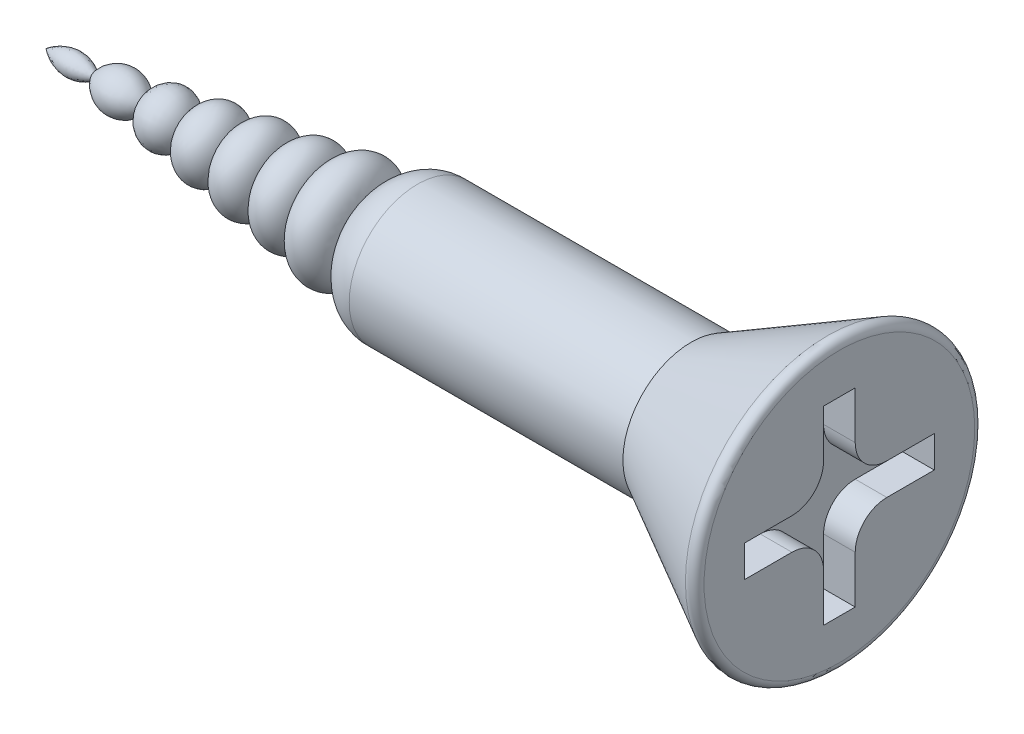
ISO-10303-21;
HEADER;
FILE_DESCRIPTION(('STEP AP214'),'2;1');
FILE_NAME('part.step','',(''),(''),'','','');
FILE_SCHEMA(('AUTOMOTIVE_DESIGN { 1 0 10303 214 1 1 1 1 }'));
ENDSEC;
DATA;
#1=APPLICATION_CONTEXT('core data for automotive mechanical design processes');
#2=APPLICATION_PROTOCOL_DEFINITION('international standard','automotive_design',2000,#1);
#3=PRODUCT_CONTEXT('',#1,'mechanical');
#4=PRODUCT('Part','Part','',(#3));
#5=PRODUCT_RELATED_PRODUCT_CATEGORY('part','',(#4));
#6=PRODUCT_DEFINITION_FORMATION('','',#4);
#7=PRODUCT_DEFINITION_CONTEXT('part definition',#1,'design');
#8=PRODUCT_DEFINITION('design','',#6,#7);
#9=PRODUCT_DEFINITION_SHAPE('','',#8);
#10=(LENGTH_UNIT() NAMED_UNIT(*) SI_UNIT(.MILLI.,.METRE.));
#11=(NAMED_UNIT(*) PLANE_ANGLE_UNIT() SI_UNIT($,.RADIAN.));
#12=(NAMED_UNIT(*) SI_UNIT($,.STERADIAN.) SOLID_ANGLE_UNIT());
#13=UNCERTAINTY_MEASURE_WITH_UNIT(LENGTH_MEASURE(1.E-05),#10,'distance_accuracy_value','');
#14=(GEOMETRIC_REPRESENTATION_CONTEXT(3) GLOBAL_UNCERTAINTY_ASSIGNED_CONTEXT((#13)) GLOBAL_UNIT_ASSIGNED_CONTEXT((#10,
#11,#12)) REPRESENTATION_CONTEXT('',''));
#15=CARTESIAN_POINT('',(0.,0.,0.));
#16=DIRECTION('',(0.,0.,1.));
#17=DIRECTION('',(1.,0.,0.));
#18=AXIS2_PLACEMENT_3D('',#15,#16,#17);
#19=CARTESIAN_POINT('',(-9.36602353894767,-2.20303519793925,0.));
#20=DIRECTION('',(0.,0.,1.));
#21=DIRECTION('',(-2.40992072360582E-12,1.,0.));
#22=AXIS2_PLACEMENT_3D('',#19,#20,#21);
#23=ELLIPSE('',#22,0.460688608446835,0.368550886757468);
#24=TRIMMED_CURVE('',#23,(PARAMETER_VALUE(4.30280690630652)),
(PARAMETER_VALUE(8.26356370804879)),.T.,.PARAMETER.);
#25=CARTESIAN_POINT('',(-12.7394679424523,-2.38649338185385,0.));
#26=DIRECTION('',(-1.,0.,0.));
#27=AXIS1_PLACEMENT('',#25,#26);
#28=SURFACE_OF_REVOLUTION('',#24,#27);
#29=CARTESIAN_POINT('',(-9.72958077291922,-2.38649338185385,0.));
#30=DIRECTION('',(-1.,0.,0.));
#31=DIRECTION('',(0.,0.,1.));
#32=AXIS2_PLACEMENT_3D('',#29,#30,#31);
#33=CIRCLE('',#32,0.259038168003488);
#34=CARTESIAN_POINT('',(-9.72958077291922,-2.38649338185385,0.259038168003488));
#35=VERTEX_POINT('',#34);
#36=EDGE_CURVE('E316',#35,#35,#33,.T.);
#37=ORIENTED_EDGE('',*,*,#36,.F.);
#38=EDGE_LOOP('',(#37));
#39=FACE_BOUND('',#38,.T.);
#40=CARTESIAN_POINT('',(-9.00624476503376,-2.38649338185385,0.));
#41=DIRECTION('',(-1.,0.,0.));
#42=DIRECTION('',(0.,0.,1.));
#43=AXIS2_PLACEMENT_3D('',#40,#41,#42);
#44=CIRCLE('',#43,0.283372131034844);
#45=CARTESIAN_POINT('',(-9.00624476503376,-2.38649338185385,0.283372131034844));
#46=VERTEX_POINT('',#45);
#47=EDGE_CURVE('E235',#46,#46,#44,.T.);
#48=ORIENTED_EDGE('',*,*,#47,.T.);
#49=EDGE_LOOP('',(#48));
#50=FACE_BOUND('',#49,.T.);
#51=ADVANCED_FACE('F42',(#39,#50),#28,.T.);
#52=CARTESIAN_POINT('',(-10.0733865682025,-2.31971443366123,0.));
#53=DIRECTION('',(0.,0.,1.));
#54=DIRECTION('',(-1.17907537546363E-12,1.,0.));
#55=AXIS2_PLACEMENT_3D('',#52,#53,#54);
#56=ELLIPSE('',#55,0.470802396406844,0.376641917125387);
#57=TRIMMED_CURVE('',#56,(PARAMETER_VALUE(4.57006829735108)),(PARAMETER_VALUE(7.9963023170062)),
.T.,.PARAMETER.);
#58=CARTESIAN_POINT('',(-12.7394679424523,-2.38649338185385,0.));
#59=DIRECTION('',(-1.,0.,0.));
#60=AXIS1_PLACEMENT('',#58,#59);
#61=SURFACE_OF_REVOLUTION('',#57,#60);
#62=CARTESIAN_POINT('',(-10.4403368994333,-2.38649338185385,0.));
#63=DIRECTION('',(-1.,0.,0.));
#64=DIRECTION('',(0.,0.,1.));
#65=AXIS2_PLACEMENT_3D('',#62,#63,#64);
#66=CIRCLE('',#65,0.172893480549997);
#67=CARTESIAN_POINT('',(-10.4403368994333,-2.38649338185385,0.172893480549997));
#68=VERTEX_POINT('',#67);
#69=EDGE_CURVE('E319',#68,#68,#66,.T.);
#70=ORIENTED_EDGE('',*,*,#69,.F.);
#71=EDGE_LOOP('',(#70));
#72=FACE_BOUND('',#71,.T.);
#73=ORIENTED_EDGE('',*,*,#36,.T.);
#74=EDGE_LOOP('',(#73));
#75=FACE_BOUND('',#74,.T.);
#76=ADVANCED_FACE('F258',(#72,#75),#61,.T.);
#77=CARTESIAN_POINT('',(-10.7826752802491,-2.45427353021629,0.));
#78=DIRECTION('',(0.,0.,1.));
#79=DIRECTION('',(-2.26133022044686E-13,1.,0.));
#80=AXIS2_PLACEMENT_3D('',#77,#78,#79);
#81=ELLIPSE('',#80,0.490960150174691,0.392768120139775);
#82=TRIMMED_CURVE('',#81,(PARAMETER_VALUE(4.85088764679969)),
(PARAMETER_VALUE(7.71548296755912)),.T.,.PARAMETER.);
#83=CARTESIAN_POINT('',(-12.7394679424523,-2.38649338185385,0.));
#84=DIRECTION('',(-1.,0.,0.));
#85=AXIS1_PLACEMENT('',#83,#84);
#86=SURFACE_OF_REVOLUTION('',#82,#85);
#87=CARTESIAN_POINT('',(-11.1462812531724,-2.38649338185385,0.));
#88=DIRECTION('',(-1.,0.,0.));
#89=DIRECTION('',(0.,0.,1.));
#90=AXIS2_PLACEMENT_3D('',#87,#88,#89);
#91=CIRCLE('',#90,0.117866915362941);
#92=CARTESIAN_POINT('',(-11.1462812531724,-2.38649338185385,0.117866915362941));
#93=VERTEX_POINT('',#92);
#94=EDGE_CURVE('E322',#93,#93,#91,.T.);
#95=ORIENTED_EDGE('',*,*,#94,.F.);
#96=EDGE_LOOP('',(#95));
#97=FACE_BOUND('',#96,.T.);
#98=ORIENTED_EDGE('',*,*,#69,.T.);
#99=EDGE_LOOP('',(#98));
#100=FACE_BOUND('',#99,.T.);
#101=ADVANCED_FACE('F377',(#97,#100),#86,.T.);
#102=CARTESIAN_POINT('',(-11.5336968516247,-2.77445620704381,0.));
#103=DIRECTION('',(0.,0.,1.));
#104=DIRECTION('',(-1.58541716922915E-13,1.,0.));
#105=AXIS2_PLACEMENT_3D('',#102,#103,#104);
#106=ELLIPSE('',#105,0.700271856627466,0.560217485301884);
#107=TRIMMED_CURVE('',#106,(PARAMETER_VALUE(5.299571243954)),
(PARAMETER_VALUE(7.26679937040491)),.T.,.PARAMETER.);
#108=CARTESIAN_POINT('',(-12.7394679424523,-2.38649338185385,0.));
#109=DIRECTION('',(-1.,0.,0.));
#110=AXIS1_PLACEMENT('',#108,#109);
#111=SURFACE_OF_REVOLUTION('',#107,#110);
#112=CARTESIAN_POINT('',(-11.9626803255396,-2.38649338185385,0.));
#113=DIRECTION('',(-1.,0.,0.));
#114=DIRECTION('',(0.,0.,1.));
#115=AXIS2_PLACEMENT_3D('',#112,#113,#114);
#116=CIRCLE('',#115,0.0624134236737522);
#117=CARTESIAN_POINT('',(-11.9626803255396,-2.38649338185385,0.0624134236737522));
#118=VERTEX_POINT('',#117);
#119=EDGE_CURVE('E325',#118,#118,#116,.T.);
#120=ORIENTED_EDGE('',*,*,#119,.F.);
#121=EDGE_LOOP('',(#120));
#122=FACE_BOUND('',#121,.T.);
#123=ORIENTED_EDGE('',*,*,#94,.T.);
#124=EDGE_LOOP('',(#123));
#125=FACE_BOUND('',#124,.T.);
#126=ADVANCED_FACE('F374',(#122,#125),#111,.T.);
#127=CARTESIAN_POINT('',(-12.4406178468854,-4.43589931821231,0.));
#128=DIRECTION('',(0.,0.,1.));
#129=DIRECTION('',(0.0854040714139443,0.996346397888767,0.));
#130=AXIS2_PLACEMENT_3D('',#127,#128,#129);
#131=ELLIPSE('',#130,2.22369935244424,1.12136953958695);
#132=TRIMMED_CURVE('',#131,(PARAMETER_VALUE(5.9343574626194)),
(PARAMETER_VALUE(6.71841054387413)),.T.,.PARAMETER.);
#133=CARTESIAN_POINT('',(-12.7394679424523,-2.38649338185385,0.));
#134=DIRECTION('',(-1.,0.,0.));
#135=AXIS1_PLACEMENT('',#133,#134);
#136=SURFACE_OF_REVOLUTION('',#132,#135);
#137=CARTESIAN_POINT('',(-12.7394679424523,-2.38649338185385,0.));
#138=VERTEX_POINT('',#137);
#139=VERTEX_LOOP('',#138);
#140=FACE_BOUND('',#139,.T.);
#141=ORIENTED_EDGE('',*,*,#119,.T.);
#142=EDGE_LOOP('',(#141));
#143=FACE_BOUND('',#142,.T.);
#144=ADVANCED_FACE('F369',(#140,#143),#136,.T.);
#145=CARTESIAN_POINT('',(0.,0.,0.));
#146=DIRECTION('',(1.,0.,0.));
#147=DIRECTION('',(0.,0.,-1.));
#148=AXIS2_PLACEMENT_3D('',#145,#146,#147);
#149=PLANE('',#148);
#150=CARTESIAN_POINT('',(0.,-2.38649338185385,0.));
#151=DIRECTION('',(1.,0.,0.));
#152=DIRECTION('',(0.,0.,-1.));
#153=AXIS2_PLACEMENT_3D('',#150,#151,#152);
#154=CIRCLE('',#153,2.17313684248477);
#155=CARTESIAN_POINT('',(0.,-2.38649338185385,-2.17313684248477));
#156=VERTEX_POINT('',#155);
#157=EDGE_CURVE('E12',#156,#156,#154,.T.);
#158=ORIENTED_EDGE('',*,*,#157,.T.);
#159=EDGE_LOOP('',(#158));
#160=FACE_BOUND('',#159,.T.);
#161=DIRECTION('',(0.,-1.,0.));
#162=VECTOR('',#161,1.);
#163=CARTESIAN_POINT('',(0.,-3.91049338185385,0.254));
#164=LINE('',#163,#162);
#165=CARTESIAN_POINT('',(0.,-3.14849338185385,0.254));
#166=VERTEX_POINT('',#165);
#167=CARTESIAN_POINT('',(0.,-3.91049338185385,0.254));
#168=VERTEX_POINT('',#167);
#169=EDGE_CURVE('E218',#166,#168,#164,.T.);
#170=ORIENTED_EDGE('',*,*,#169,.F.);
#171=CARTESIAN_POINT('',(0.,-3.14849338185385,0.762));
#172=DIRECTION('',(1.,0.,0.));
#173=DIRECTION('',(0.,0.,-1.));
#174=AXIS2_PLACEMENT_3D('',#171,#172,#173);
#175=CIRCLE('',#174,0.508);
#176=CARTESIAN_POINT('',(0.,-2.64049338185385,0.762));
#177=VERTEX_POINT('',#176);
#178=EDGE_CURVE('E305',#166,#177,#175,.T.);
#179=ORIENTED_EDGE('',*,*,#178,.T.);
#180=DIRECTION('',(0.,0.,-1.));
#181=VECTOR('',#180,1.);
#182=CARTESIAN_POINT('',(0.,-2.64049338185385,0.254));
#183=LINE('',#182,#181);
#184=CARTESIAN_POINT('',(0.,-2.64049338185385,1.524));
#185=VERTEX_POINT('',#184);
#186=EDGE_CURVE('E215',#185,#177,#183,.T.);
#187=ORIENTED_EDGE('',*,*,#186,.F.);
#188=DIRECTION('',(0.,-1.,0.));
#189=VECTOR('',#188,1.);
#190=CARTESIAN_POINT('',(0.,-2.13249338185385,1.524));
#191=LINE('',#190,#189);
#192=CARTESIAN_POINT('',(0.,-2.13249338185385,1.524));
#193=VERTEX_POINT('',#192);
#194=EDGE_CURVE('E212',#193,#185,#191,.T.);
#195=ORIENTED_EDGE('',*,*,#194,.F.);
#196=DIRECTION('',(0.,0.,1.));
#197=VECTOR('',#196,1.);
#198=CARTESIAN_POINT('',(0.,-2.13249338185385,0.254));
#199=LINE('',#198,#197);
#200=CARTESIAN_POINT('',(0.,-2.13249338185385,0.762));
#201=VERTEX_POINT('',#200);
#202=EDGE_CURVE('E210',#201,#193,#199,.T.);
#203=ORIENTED_EDGE('',*,*,#202,.F.);
#204=CARTESIAN_POINT('',(0.,-1.62449338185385,0.762));
#205=DIRECTION('',(1.,0.,0.));
#206=DIRECTION('',(0.,0.,-1.));
#207=AXIS2_PLACEMENT_3D('',#204,#205,#206);
#208=CIRCLE('',#207,0.508);
#209=CARTESIAN_POINT('',(0.,-1.62449338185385,0.254));
#210=VERTEX_POINT('',#209);
#211=EDGE_CURVE('E311',#201,#210,#208,.T.);
#212=ORIENTED_EDGE('',*,*,#211,.T.);
#213=DIRECTION('',(0.,-1.,0.));
#214=VECTOR('',#213,1.);
#215=CARTESIAN_POINT('',(0.,-0.862493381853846,0.254));
#216=LINE('',#215,#214);
#217=CARTESIAN_POINT('',(0.,-0.862493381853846,0.254));
#218=VERTEX_POINT('',#217);
#219=EDGE_CURVE('E208',#218,#210,#216,.T.);
#220=ORIENTED_EDGE('',*,*,#219,.F.);
#221=DIRECTION('',(0.,0.,1.));
#222=VECTOR('',#221,1.);
#223=CARTESIAN_POINT('',(0.,-0.862493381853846,-0.254));
#224=LINE('',#223,#222);
#225=CARTESIAN_POINT('',(0.,-0.862493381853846,-0.254));
#226=VERTEX_POINT('',#225);
#227=EDGE_CURVE('E166',#226,#218,#224,.T.);
#228=ORIENTED_EDGE('',*,*,#227,.F.);
#229=DIRECTION('',(0.,1.,0.));
#230=VECTOR('',#229,1.);
#231=CARTESIAN_POINT('',(0.,-0.862493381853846,-0.254));
#232=LINE('',#231,#230);
#233=CARTESIAN_POINT('',(0.,-1.62449338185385,-0.254));
#234=VERTEX_POINT('',#233);
#235=EDGE_CURVE('E178',#234,#226,#232,.T.);
#236=ORIENTED_EDGE('',*,*,#235,.F.);
#237=CARTESIAN_POINT('',(0.,-1.62449338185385,-0.762));
#238=DIRECTION('',(1.,0.,0.));
#239=DIRECTION('',(0.,0.,-1.));
#240=AXIS2_PLACEMENT_3D('',#237,#238,#239);
#241=CIRCLE('',#240,0.508);
#242=CARTESIAN_POINT('',(0.,-2.13249338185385,-0.762));
#243=VERTEX_POINT('',#242);
#244=EDGE_CURVE('E309',#234,#243,#241,.T.);
#245=ORIENTED_EDGE('',*,*,#244,.T.);
#246=DIRECTION('',(0.,0.,1.));
#247=VECTOR('',#246,1.);
#248=CARTESIAN_POINT('',(0.,-2.13249338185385,-0.254));
#249=LINE('',#248,#247);
#250=CARTESIAN_POINT('',(0.,-2.13249338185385,-1.524));
#251=VERTEX_POINT('',#250);
#252=EDGE_CURVE('E180',#251,#243,#249,.T.);
#253=ORIENTED_EDGE('',*,*,#252,.F.);
#254=DIRECTION('',(0.,1.,0.));
#255=VECTOR('',#254,1.);
#256=CARTESIAN_POINT('',(0.,-2.13249338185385,-1.524));
#257=LINE('',#256,#255);
#258=CARTESIAN_POINT('',(0.,-2.64049338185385,-1.524));
#259=VERTEX_POINT('',#258);
#260=EDGE_CURVE('E228',#259,#251,#257,.T.);
#261=ORIENTED_EDGE('',*,*,#260,.F.);
#262=DIRECTION('',(0.,0.,-1.));
#263=VECTOR('',#262,1.);
#264=CARTESIAN_POINT('',(0.,-2.64049338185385,-0.254));
#265=LINE('',#264,#263);
#266=CARTESIAN_POINT('',(0.,-2.64049338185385,-0.762));
#267=VERTEX_POINT('',#266);
#268=EDGE_CURVE('E226',#267,#259,#265,.T.);
#269=ORIENTED_EDGE('',*,*,#268,.F.);
#270=CARTESIAN_POINT('',(0.,-3.14849338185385,-0.762));
#271=DIRECTION('',(1.,0.,0.));
#272=DIRECTION('',(0.,0.,-1.));
#273=AXIS2_PLACEMENT_3D('',#270,#271,#272);
#274=CIRCLE('',#273,0.508);
#275=CARTESIAN_POINT('',(0.,-3.14849338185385,-0.254));
#276=VERTEX_POINT('',#275);
#277=EDGE_CURVE('E307',#267,#276,#274,.T.);
#278=ORIENTED_EDGE('',*,*,#277,.T.);
#279=DIRECTION('',(0.,1.,0.));
#280=VECTOR('',#279,1.);
#281=CARTESIAN_POINT('',(0.,-3.91049338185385,-0.254));
#282=LINE('',#281,#280);
#283=CARTESIAN_POINT('',(0.,-3.91049338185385,-0.254));
#284=VERTEX_POINT('',#283);
#285=EDGE_CURVE('E223',#284,#276,#282,.T.);
#286=ORIENTED_EDGE('',*,*,#285,.F.);
#287=DIRECTION('',(0.,0.,-1.));
#288=VECTOR('',#287,1.);
#289=CARTESIAN_POINT('',(0.,-3.91049338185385,0.254));
#290=LINE('',#289,#288);
#291=EDGE_CURVE('E220',#168,#284,#290,.T.);
#292=ORIENTED_EDGE('',*,*,#291,.F.);
#293=EDGE_LOOP('',(#170,#179,#187,#195,#203,#212,#220,#228,#236,#245,#253,#261,#269,#278,#286,#292));
#294=FACE_BOUND('',#293,.T.);
#295=ADVANCED_FACE('F373',(#160,#294),#149,.T.);
#296=CARTESIAN_POINT('',(-2.38086751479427,-2.38649338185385,0.));
#297=DIRECTION('',(1.,0.,0.));
#298=DIRECTION('',(0.,0.,-1.));
#299=AXIS2_PLACEMENT_3D('',#296,#297,#298);
#300=CONICAL_SURFACE('',#299,1.09520012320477,0.496960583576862);
#301=CARTESIAN_POINT('',(-0.187548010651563,-2.38649338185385,0.));
#302=DIRECTION('',(-1.,0.,0.));
#303=DIRECTION('',(0.,0.,1.));
#304=AXIS2_PLACEMENT_3D('',#301,#302,#303);
#305=CIRCLE('',#304,2.28477437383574);
#306=CARTESIAN_POINT('',(-0.187548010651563,-2.38649338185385,2.28477437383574));
#307=VERTEX_POINT('',#306);
#308=EDGE_CURVE('E50',#307,#307,#305,.T.);
#309=ORIENTED_EDGE('',*,*,#308,.T.);
#310=EDGE_LOOP('',(#309));
#311=FACE_BOUND('',#310,.T.);
#312=CARTESIAN_POINT('',(-2.38086751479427,-2.38649338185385,0.));
#313=DIRECTION('',(-1.,0.,0.));
#314=DIRECTION('',(0.,0.,1.));
#315=AXIS2_PLACEMENT_3D('',#312,#313,#314);
#316=CIRCLE('',#315,1.09520012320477);
#317=CARTESIAN_POINT('',(-2.38086751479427,-2.38649338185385,1.09520012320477));
#318=VERTEX_POINT('',#317);
#319=EDGE_CURVE('E328',#318,#318,#316,.T.);
#320=ORIENTED_EDGE('',*,*,#319,.F.);
#321=EDGE_LOOP('',(#320));
#322=FACE_BOUND('',#321,.T.);
#323=ADVANCED_FACE('F402',(#311,#322),#300,.T.);
#324=CARTESIAN_POINT('',(-12.7394679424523,-2.38649338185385,0.));
#325=DIRECTION('',(-1.,0.,0.));
#326=DIRECTION('',(0.,0.,1.));
#327=AXIS2_PLACEMENT_3D('',#324,#325,#326);
#328=CYLINDRICAL_SURFACE('',#327,1.09520012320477);
#329=CARTESIAN_POINT('',(-6.77510724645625,-2.38649338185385,0.));
#330=DIRECTION('',(-1.,0.,0.));
#331=DIRECTION('',(0.,0.,1.));
#332=AXIS2_PLACEMENT_3D('',#329,#330,#331);
#333=CIRCLE('',#332,1.09520012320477);
#334=CARTESIAN_POINT('',(-6.77510724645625,-2.38649338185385,1.09520012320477));
#335=VERTEX_POINT('',#334);
#336=EDGE_CURVE('E331',#335,#335,#333,.T.);
#337=ORIENTED_EDGE('',*,*,#336,.F.);
#338=EDGE_LOOP('',(#337));
#339=FACE_BOUND('',#338,.T.);
#340=ORIENTED_EDGE('',*,*,#319,.T.);
#341=EDGE_LOOP('',(#340));
#342=FACE_BOUND('',#341,.T.);
#343=ADVANCED_FACE('F360',(#339,#342),#328,.T.);
#344=CARTESIAN_POINT('',(-6.80284435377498,-2.2389029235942,0.));
#345=DIRECTION('',(0.,0.,1.));
#346=DIRECTION('',(-1.17082031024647E-13,1.,0.));
#347=AXIS2_PLACEMENT_3D('',#344,#345,#346);
#348=ELLIPSE('',#347,0.948243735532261,0.758594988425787);
#349=TRIMMED_CURVE('',#348,(PARAMETER_VALUE(4.55610746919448)),
(PARAMETER_VALUE(8.01026314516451)),.T.,.PARAMETER.);
#350=CARTESIAN_POINT('',(-12.7394679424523,-2.38649338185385,0.));
#351=DIRECTION('',(-1.,0.,0.));
#352=AXIS1_PLACEMENT('',#350,#351);
#353=SURFACE_OF_REVOLUTION('',#349,#352);
#354=CARTESIAN_POINT('',(-7.54551189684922,-2.38649338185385,0.));
#355=DIRECTION('',(-1.,0.,0.));
#356=DIRECTION('',(0.,0.,1.));
#357=AXIS2_PLACEMENT_3D('',#354,#355,#356);
#358=CIRCLE('',#357,0.34088135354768);
#359=CARTESIAN_POINT('',(-7.54551189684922,-2.38649338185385,0.34088135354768));
#360=VERTEX_POINT('',#359);
#361=EDGE_CURVE('E334',#360,#360,#358,.T.);
#362=ORIENTED_EDGE('',*,*,#361,.F.);
#363=EDGE_LOOP('',(#362));
#364=FACE_BOUND('',#363,.T.);
#365=ORIENTED_EDGE('',*,*,#336,.T.);
#366=EDGE_LOOP('',(#365));
#367=FACE_BOUND('',#366,.T.);
#368=ADVANCED_FACE('F356',(#364,#367),#353,.T.);
#369=CARTESIAN_POINT('',(-7.91895444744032,-1.99250010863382,0.));
#370=DIRECTION('',(0.,0.,1.));
#371=DIRECTION('',(3.78097124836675E-12,1.,0.));
#372=AXIS2_PLACEMENT_3D('',#369,#370,#371);
#373=ELLIPSE('',#372,0.469814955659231,0.375851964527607);
#374=TRIMMED_CURVE('',#373,(PARAMETER_VALUE(3.71765565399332)),
(PARAMETER_VALUE(8.84871496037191)),.T.,.PARAMETER.);
#375=CARTESIAN_POINT('',(-12.7394679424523,-2.38649338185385,0.));
#376=DIRECTION('',(-1.,0.,0.));
#377=AXIS1_PLACEMENT('',#375,#376);
#378=SURFACE_OF_REVOLUTION('',#374,#377);
#379=CARTESIAN_POINT('',(-8.29437630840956,-2.38649338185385,0.));
#380=DIRECTION('',(-1.,0.,0.));
#381=DIRECTION('',(0.,0.,1.));
#382=AXIS2_PLACEMENT_3D('',#379,#380,#381);
#383=CIRCLE('',#382,0.416462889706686);
#384=CARTESIAN_POINT('',(-8.29437630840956,-2.38649338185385,0.416462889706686));
#385=VERTEX_POINT('',#384);
#386=EDGE_CURVE('E337',#385,#385,#383,.T.);
#387=ORIENTED_EDGE('',*,*,#386,.F.);
#388=EDGE_LOOP('',(#387));
#389=FACE_BOUND('',#388,.T.);
#390=ORIENTED_EDGE('',*,*,#361,.T.);
#391=EDGE_LOOP('',(#390));
#392=FACE_BOUND('',#391,.T.);
#393=ADVANCED_FACE('F351',(#389,#392),#378,.T.);
#394=CARTESIAN_POINT('',(-8.64091881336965,-2.11506638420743,0.));
#395=DIRECTION('',(0.,0.,1.));
#396=DIRECTION('',(3.15947204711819E-12,1.,0.));
#397=AXIS2_PLACEMENT_3D('',#394,#395,#396);
#398=ELLIPSE('',#397,0.456813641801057,0.365450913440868);
#399=TRIMMED_CURVE('',#398,(PARAMETER_VALUE(4.07615008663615)),
(PARAMETER_VALUE(8.49022052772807)),.T.,.PARAMETER.);
#400=CARTESIAN_POINT('',(-12.7394679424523,-2.38649338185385,0.));
#401=DIRECTION('',(-1.,0.,0.));
#402=AXIS1_PLACEMENT('',#400,#401);
#403=SURFACE_OF_REVOLUTION('',#399,#402);
#404=ORIENTED_EDGE('',*,*,#47,.F.);
#405=EDGE_LOOP('',(#404));
#406=FACE_BOUND('',#405,.T.);
#407=ORIENTED_EDGE('',*,*,#386,.T.);
#408=EDGE_LOOP('',(#407));
#409=FACE_BOUND('',#408,.T.);
#410=ADVANCED_FACE('F347',(#406,#409),#403,.T.);
#411=CARTESIAN_POINT('',(-0.508,-0.862493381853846,-0.254));
#412=DIRECTION('',(0.,1.,0.));
#413=DIRECTION('',(0.,0.,1.));
#414=AXIS2_PLACEMENT_3D('',#411,#412,#413);
#415=PLANE('',#414);
#416=ORIENTED_EDGE('',*,*,#227,.T.);
#417=DIRECTION('',(1.,0.,0.));
#418=VECTOR('',#417,1.);
#419=CARTESIAN_POINT('',(-0.508,-0.862493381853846,0.254));
#420=LINE('',#419,#418);
#421=CARTESIAN_POINT('',(-0.508,-0.862493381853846,0.254));
#422=VERTEX_POINT('',#421);
#423=EDGE_CURVE('E160',#422,#218,#420,.T.);
#424=ORIENTED_EDGE('',*,*,#423,.F.);
#425=DIRECTION('',(0.,0.,1.));
#426=VECTOR('',#425,1.);
#427=CARTESIAN_POINT('',(-0.508,-0.862493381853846,-0.254));
#428=LINE('',#427,#426);
#429=CARTESIAN_POINT('',(-0.508,-0.862493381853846,-0.254));
#430=VERTEX_POINT('',#429);
#431=EDGE_CURVE('E164',#430,#422,#428,.T.);
#432=ORIENTED_EDGE('',*,*,#431,.F.);
#433=DIRECTION('',(1.,0.,0.));
#434=VECTOR('',#433,1.);
#435=CARTESIAN_POINT('',(-0.508,-0.862493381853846,-0.254));
#436=LINE('',#435,#434);
#437=EDGE_CURVE('E233',#430,#226,#436,.T.);
#438=ORIENTED_EDGE('',*,*,#437,.T.);
#439=EDGE_LOOP('',(#416,#424,#432,#438));
#440=FACE_BOUND('',#439,.T.);
#441=ADVANCED_FACE('F161',(#440),#415,.F.);
#442=CARTESIAN_POINT('',(-0.508,-0.862493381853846,-0.254));
#443=DIRECTION('',(0.,0.,-1.));
#444=DIRECTION('',(0.,1.,0.));
#445=AXIS2_PLACEMENT_3D('',#442,#443,#444);
#446=PLANE('',#445);
#447=DIRECTION('',(0.,1.,0.));
#448=VECTOR('',#447,1.);
#449=CARTESIAN_POINT('',(-0.508,-0.862493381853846,-0.254));
#450=LINE('',#449,#448);
#451=CARTESIAN_POINT('',(-0.508,-1.62449338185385,-0.254));
#452=VERTEX_POINT('',#451);
#453=EDGE_CURVE('E169',#452,#430,#450,.T.);
#454=ORIENTED_EDGE('',*,*,#453,.F.);
#455=DIRECTION('',(1.,0.,0.));
#456=VECTOR('',#455,1.);
#457=CARTESIAN_POINT('',(-0.508,-1.62449338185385,-0.254));
#458=LINE('',#457,#456);
#459=EDGE_CURVE('E295',#452,#234,#458,.T.);
#460=ORIENTED_EDGE('',*,*,#459,.T.);
#461=ORIENTED_EDGE('',*,*,#235,.T.);
#462=ORIENTED_EDGE('',*,*,#437,.F.);
#463=EDGE_LOOP('',(#454,#460,#461,#462));
#464=FACE_BOUND('',#463,.T.);
#465=ADVANCED_FACE('F474',(#464),#446,.F.);
#466=CARTESIAN_POINT('',(-0.508,-2.13249338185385,-0.254));
#467=DIRECTION('',(0.,1.,0.));
#468=DIRECTION('',(0.,0.,1.));
#469=AXIS2_PLACEMENT_3D('',#466,#467,#468);
#470=PLANE('',#469);
#471=ORIENTED_EDGE('',*,*,#252,.T.);
#472=DIRECTION('',(1.,0.,0.));
#473=VECTOR('',#472,1.);
#474=CARTESIAN_POINT('',(-0.508,-2.13249338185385,-0.762));
#475=LINE('',#474,#473);
#476=CARTESIAN_POINT('',(-0.508,-2.13249338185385,-0.762));
#477=VERTEX_POINT('',#476);
#478=EDGE_CURVE('E293',#243,#477,#475,.F.);
#479=ORIENTED_EDGE('',*,*,#478,.T.);
#480=DIRECTION('',(0.,0.,1.));
#481=VECTOR('',#480,1.);
#482=CARTESIAN_POINT('',(-0.508,-2.13249338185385,-0.254));
#483=LINE('',#482,#481);
#484=CARTESIAN_POINT('',(-0.508,-2.13249338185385,-1.524));
#485=VERTEX_POINT('',#484);
#486=EDGE_CURVE('E203',#485,#477,#483,.T.);
#487=ORIENTED_EDGE('',*,*,#486,.F.);
#488=DIRECTION('',(1.,0.,0.));
#489=VECTOR('',#488,1.);
#490=CARTESIAN_POINT('',(-0.508,-2.13249338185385,-1.524));
#491=LINE('',#490,#489);
#492=EDGE_CURVE('E236',#485,#251,#491,.T.);
#493=ORIENTED_EDGE('',*,*,#492,.T.);
#494=EDGE_LOOP('',(#471,#479,#487,#493));
#495=FACE_BOUND('',#494,.T.);
#496=ADVANCED_FACE('F470',(#495),#470,.F.);
#497=CARTESIAN_POINT('',(-0.508,-2.13249338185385,-1.524));
#498=DIRECTION('',(0.,0.,-1.));
#499=DIRECTION('',(-1.,0.,0.));
#500=AXIS2_PLACEMENT_3D('',#497,#498,#499);
#501=PLANE('',#500);
#502=ORIENTED_EDGE('',*,*,#260,.T.);
#503=ORIENTED_EDGE('',*,*,#492,.F.);
#504=DIRECTION('',(0.,1.,0.));
#505=VECTOR('',#504,1.);
#506=CARTESIAN_POINT('',(-0.508,-2.13249338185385,-1.524));
#507=LINE('',#506,#505);
#508=CARTESIAN_POINT('',(-0.508,-2.64049338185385,-1.524));
#509=VERTEX_POINT('',#508);
#510=EDGE_CURVE('E200',#509,#485,#507,.T.);
#511=ORIENTED_EDGE('',*,*,#510,.F.);
#512=DIRECTION('',(1.,0.,0.));
#513=VECTOR('',#512,1.);
#514=CARTESIAN_POINT('',(-0.508,-2.64049338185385,-1.524));
#515=LINE('',#514,#513);
#516=EDGE_CURVE('E238',#509,#259,#515,.T.);
#517=ORIENTED_EDGE('',*,*,#516,.T.);
#518=EDGE_LOOP('',(#502,#503,#511,#517));
#519=FACE_BOUND('',#518,.T.);
#520=ADVANCED_FACE('F466',(#519),#501,.F.);
#521=CARTESIAN_POINT('',(-0.508,-2.64049338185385,-0.254));
#522=DIRECTION('',(0.,-1.,0.));
#523=DIRECTION('',(0.,0.,-1.));
#524=AXIS2_PLACEMENT_3D('',#521,#522,#523);
#525=PLANE('',#524);
#526=DIRECTION('',(0.,0.,-1.));
#527=VECTOR('',#526,1.);
#528=CARTESIAN_POINT('',(-0.508,-2.64049338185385,-0.254));
#529=LINE('',#528,#527);
#530=CARTESIAN_POINT('',(-0.508,-2.64049338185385,-0.762));
#531=VERTEX_POINT('',#530);
#532=EDGE_CURVE('E198',#531,#509,#529,.T.);
#533=ORIENTED_EDGE('',*,*,#532,.F.);
#534=DIRECTION('',(1.,0.,0.));
#535=VECTOR('',#534,1.);
#536=CARTESIAN_POINT('',(-0.508,-2.64049338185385,-0.762));
#537=LINE('',#536,#535);
#538=EDGE_CURVE('E300',#531,#267,#537,.T.);
#539=ORIENTED_EDGE('',*,*,#538,.T.);
#540=ORIENTED_EDGE('',*,*,#268,.T.);
#541=ORIENTED_EDGE('',*,*,#516,.F.);
#542=EDGE_LOOP('',(#533,#539,#540,#541));
#543=FACE_BOUND('',#542,.T.);
#544=ADVANCED_FACE('F462',(#543),#525,.F.);
#545=CARTESIAN_POINT('',(-0.508,-3.91049338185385,-0.254));
#546=DIRECTION('',(0.,0.,-1.));
#547=DIRECTION('',(0.,1.,0.));
#548=AXIS2_PLACEMENT_3D('',#545,#546,#547);
#549=PLANE('',#548);
#550=ORIENTED_EDGE('',*,*,#285,.T.);
#551=DIRECTION('',(1.,0.,0.));
#552=VECTOR('',#551,1.);
#553=CARTESIAN_POINT('',(-0.508,-3.14849338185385,-0.254));
#554=LINE('',#553,#552);
#555=CARTESIAN_POINT('',(-0.508,-3.14849338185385,-0.254));
#556=VERTEX_POINT('',#555);
#557=EDGE_CURVE('E298',#276,#556,#554,.F.);
#558=ORIENTED_EDGE('',*,*,#557,.T.);
#559=DIRECTION('',(0.,1.,0.));
#560=VECTOR('',#559,1.);
#561=CARTESIAN_POINT('',(-0.508,-3.91049338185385,-0.254));
#562=LINE('',#561,#560);
#563=CARTESIAN_POINT('',(-0.508,-3.91049338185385,-0.254));
#564=VERTEX_POINT('',#563);
#565=EDGE_CURVE('E195',#564,#556,#562,.T.);
#566=ORIENTED_EDGE('',*,*,#565,.F.);
#567=DIRECTION('',(1.,0.,0.));
#568=VECTOR('',#567,1.);
#569=CARTESIAN_POINT('',(-0.508,-3.91049338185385,-0.254));
#570=LINE('',#569,#568);
#571=EDGE_CURVE('E241',#564,#284,#570,.T.);
#572=ORIENTED_EDGE('',*,*,#571,.T.);
#573=EDGE_LOOP('',(#550,#558,#566,#572));
#574=FACE_BOUND('',#573,.T.);
#575=ADVANCED_FACE('F459',(#574),#549,.F.);
#576=CARTESIAN_POINT('',(-0.508,-3.91049338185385,0.254));
#577=DIRECTION('',(0.,-1.,0.));
#578=DIRECTION('',(0.,0.,-1.));
#579=AXIS2_PLACEMENT_3D('',#576,#577,#578);
#580=PLANE('',#579);
#581=ORIENTED_EDGE('',*,*,#291,.T.);
#582=ORIENTED_EDGE('',*,*,#571,.F.);
#583=DIRECTION('',(0.,0.,-1.));
#584=VECTOR('',#583,1.);
#585=CARTESIAN_POINT('',(-0.508,-3.91049338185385,0.254));
#586=LINE('',#585,#584);
#587=CARTESIAN_POINT('',(-0.508,-3.91049338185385,0.254));
#588=VERTEX_POINT('',#587);
#589=EDGE_CURVE('E192',#588,#564,#586,.T.);
#590=ORIENTED_EDGE('',*,*,#589,.F.);
#591=DIRECTION('',(1.,0.,0.));
#592=VECTOR('',#591,1.);
#593=CARTESIAN_POINT('',(-0.508,-3.91049338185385,0.254));
#594=LINE('',#593,#592);
#595=EDGE_CURVE('E243',#588,#168,#594,.T.);
#596=ORIENTED_EDGE('',*,*,#595,.T.);
#597=EDGE_LOOP('',(#581,#582,#590,#596));
#598=FACE_BOUND('',#597,.T.);
#599=ADVANCED_FACE('F429',(#598),#580,.F.);
#600=CARTESIAN_POINT('',(-0.508,-3.91049338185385,0.254));
#601=DIRECTION('',(0.,0.,1.));
#602=DIRECTION('',(0.,-1.,0.));
#603=AXIS2_PLACEMENT_3D('',#600,#601,#602);
#604=PLANE('',#603);
#605=DIRECTION('',(0.,-1.,0.));
#606=VECTOR('',#605,1.);
#607=CARTESIAN_POINT('',(-0.508,-3.91049338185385,0.254));
#608=LINE('',#607,#606);
#609=CARTESIAN_POINT('',(-0.508,-3.14849338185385,0.254));
#610=VERTEX_POINT('',#609);
#611=EDGE_CURVE('E190',#610,#588,#608,.T.);
#612=ORIENTED_EDGE('',*,*,#611,.F.);
#613=DIRECTION('',(1.,0.,0.));
#614=VECTOR('',#613,1.);
#615=CARTESIAN_POINT('',(-0.508,-3.14849338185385,0.254));
#616=LINE('',#615,#614);
#617=EDGE_CURVE('E313',#610,#166,#616,.T.);
#618=ORIENTED_EDGE('',*,*,#617,.T.);
#619=ORIENTED_EDGE('',*,*,#169,.T.);
#620=ORIENTED_EDGE('',*,*,#595,.F.);
#621=EDGE_LOOP('',(#612,#618,#619,#620));
#622=FACE_BOUND('',#621,.T.);
#623=ADVANCED_FACE('F425',(#622),#604,.F.);
#624=CARTESIAN_POINT('',(-0.508,-2.64049338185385,0.254));
#625=DIRECTION('',(0.,-1.,0.));
#626=DIRECTION('',(0.,0.,-1.));
#627=AXIS2_PLACEMENT_3D('',#624,#625,#626);
#628=PLANE('',#627);
#629=ORIENTED_EDGE('',*,*,#186,.T.);
#630=DIRECTION('',(1.,0.,0.));
#631=VECTOR('',#630,1.);
#632=CARTESIAN_POINT('',(-0.508,-2.64049338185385,0.762));
#633=LINE('',#632,#631);
#634=CARTESIAN_POINT('',(-0.508,-2.64049338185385,0.762));
#635=VERTEX_POINT('',#634);
#636=EDGE_CURVE('E303',#177,#635,#633,.F.);
#637=ORIENTED_EDGE('',*,*,#636,.T.);
#638=DIRECTION('',(0.,0.,-1.));
#639=VECTOR('',#638,1.);
#640=CARTESIAN_POINT('',(-0.508,-2.64049338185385,0.254));
#641=LINE('',#640,#639);
#642=CARTESIAN_POINT('',(-0.508,-2.64049338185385,1.524));
#643=VERTEX_POINT('',#642);
#644=EDGE_CURVE('E187',#643,#635,#641,.T.);
#645=ORIENTED_EDGE('',*,*,#644,.F.);
#646=DIRECTION('',(1.,0.,0.));
#647=VECTOR('',#646,1.);
#648=CARTESIAN_POINT('',(-0.508,-2.64049338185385,1.524));
#649=LINE('',#648,#647);
#650=EDGE_CURVE('E246',#643,#185,#649,.T.);
#651=ORIENTED_EDGE('',*,*,#650,.T.);
#652=EDGE_LOOP('',(#629,#637,#645,#651));
#653=FACE_BOUND('',#652,.T.);
#654=ADVANCED_FACE('F436',(#653),#628,.F.);
#655=CARTESIAN_POINT('',(-0.508,-2.13249338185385,1.524));
#656=DIRECTION('',(0.,0.,1.));
#657=DIRECTION('',(1.,0.,0.));
#658=AXIS2_PLACEMENT_3D('',#655,#656,#657);
#659=PLANE('',#658);
#660=ORIENTED_EDGE('',*,*,#194,.T.);
#661=ORIENTED_EDGE('',*,*,#650,.F.);
#662=DIRECTION('',(0.,-1.,0.));
#663=VECTOR('',#662,1.);
#664=CARTESIAN_POINT('',(-0.508,-2.13249338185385,1.524));
#665=LINE('',#664,#663);
#666=CARTESIAN_POINT('',(-0.508,-2.13249338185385,1.524));
#667=VERTEX_POINT('',#666);
#668=EDGE_CURVE('E184',#667,#643,#665,.T.);
#669=ORIENTED_EDGE('',*,*,#668,.F.);
#670=DIRECTION('',(1.,0.,0.));
#671=VECTOR('',#670,1.);
#672=CARTESIAN_POINT('',(-0.508,-2.13249338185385,1.524));
#673=LINE('',#672,#671);
#674=EDGE_CURVE('E168',#667,#193,#673,.T.);
#675=ORIENTED_EDGE('',*,*,#674,.T.);
#676=EDGE_LOOP('',(#660,#661,#669,#675));
#677=FACE_BOUND('',#676,.T.);
#678=ADVANCED_FACE('F440',(#677),#659,.F.);
#679=CARTESIAN_POINT('',(-0.508,-2.13249338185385,0.254));
#680=DIRECTION('',(0.,1.,0.));
#681=DIRECTION('',(0.,0.,1.));
#682=AXIS2_PLACEMENT_3D('',#679,#680,#681);
#683=PLANE('',#682);
#684=DIRECTION('',(0.,0.,1.));
#685=VECTOR('',#684,1.);
#686=CARTESIAN_POINT('',(-0.508,-2.13249338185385,0.254));
#687=LINE('',#686,#685);
#688=CARTESIAN_POINT('',(-0.508,-2.13249338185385,0.762));
#689=VERTEX_POINT('',#688);
#690=EDGE_CURVE('E173',#689,#667,#687,.T.);
#691=ORIENTED_EDGE('',*,*,#690,.F.);
#692=DIRECTION('',(1.,0.,0.));
#693=VECTOR('',#692,1.);
#694=CARTESIAN_POINT('',(-0.508,-2.13249338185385,0.762));
#695=LINE('',#694,#693);
#696=EDGE_CURVE('E281',#689,#201,#695,.T.);
#697=ORIENTED_EDGE('',*,*,#696,.T.);
#698=ORIENTED_EDGE('',*,*,#202,.T.);
#699=ORIENTED_EDGE('',*,*,#674,.F.);
#700=EDGE_LOOP('',(#691,#697,#698,#699));
#701=FACE_BOUND('',#700,.T.);
#702=ADVANCED_FACE('F444',(#701),#683,.F.);
#703=CARTESIAN_POINT('',(-0.508,-0.862493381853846,0.254));
#704=DIRECTION('',(0.,0.,1.));
#705=DIRECTION('',(0.,-1.,0.));
#706=AXIS2_PLACEMENT_3D('',#703,#704,#705);
#707=PLANE('',#706);
#708=ORIENTED_EDGE('',*,*,#219,.T.);
#709=DIRECTION('',(1.,0.,0.));
#710=VECTOR('',#709,1.);
#711=CARTESIAN_POINT('',(-0.508,-1.62449338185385,0.254));
#712=LINE('',#711,#710);
#713=CARTESIAN_POINT('',(-0.508,-1.62449338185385,0.254));
#714=VERTEX_POINT('',#713);
#715=EDGE_CURVE('E57',#210,#714,#712,.F.);
#716=ORIENTED_EDGE('',*,*,#715,.T.);
#717=DIRECTION('',(0.,-1.,0.));
#718=VECTOR('',#717,1.);
#719=CARTESIAN_POINT('',(-0.508,-0.862493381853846,0.254));
#720=LINE('',#719,#718);
#721=EDGE_CURVE('E171',#422,#714,#720,.T.);
#722=ORIENTED_EDGE('',*,*,#721,.F.);
#723=ORIENTED_EDGE('',*,*,#423,.T.);
#724=EDGE_LOOP('',(#708,#716,#722,#723));
#725=FACE_BOUND('',#724,.T.);
#726=ADVANCED_FACE('F172',(#725),#707,.F.);
#727=CARTESIAN_POINT('',(-0.508,0.,0.));
#728=DIRECTION('',(1.,0.,0.));
#729=DIRECTION('',(0.,0.,-1.));
#730=AXIS2_PLACEMENT_3D('',#727,#728,#729);
#731=PLANE('',#730);
#732=ORIENTED_EDGE('',*,*,#431,.T.);
#733=ORIENTED_EDGE('',*,*,#721,.T.);
#734=CARTESIAN_POINT('',(-0.508,-1.62449338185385,0.762));
#735=DIRECTION('',(1.,0.,0.));
#736=DIRECTION('',(0.,0.,-1.));
#737=AXIS2_PLACEMENT_3D('',#734,#735,#736);
#738=CIRCLE('',#737,0.508);
#739=EDGE_CURVE('E64',#714,#689,#738,.F.);
#740=ORIENTED_EDGE('',*,*,#739,.T.);
#741=ORIENTED_EDGE('',*,*,#690,.T.);
#742=ORIENTED_EDGE('',*,*,#668,.T.);
#743=ORIENTED_EDGE('',*,*,#644,.T.);
#744=CARTESIAN_POINT('',(-0.508,-3.14849338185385,0.762));
#745=DIRECTION('',(1.,0.,0.));
#746=DIRECTION('',(0.,0.,-1.));
#747=AXIS2_PLACEMENT_3D('',#744,#745,#746);
#748=CIRCLE('',#747,0.508);
#749=EDGE_CURVE('E289',#635,#610,#748,.F.);
#750=ORIENTED_EDGE('',*,*,#749,.T.);
#751=ORIENTED_EDGE('',*,*,#611,.T.);
#752=ORIENTED_EDGE('',*,*,#589,.T.);
#753=ORIENTED_EDGE('',*,*,#565,.T.);
#754=CARTESIAN_POINT('',(-0.508,-3.14849338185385,-0.762));
#755=DIRECTION('',(1.,0.,0.));
#756=DIRECTION('',(0.,0.,-1.));
#757=AXIS2_PLACEMENT_3D('',#754,#755,#756);
#758=CIRCLE('',#757,0.508);
#759=EDGE_CURVE('E285',#556,#531,#758,.F.);
#760=ORIENTED_EDGE('',*,*,#759,.T.);
#761=ORIENTED_EDGE('',*,*,#532,.T.);
#762=ORIENTED_EDGE('',*,*,#510,.T.);
#763=ORIENTED_EDGE('',*,*,#486,.T.);
#764=CARTESIAN_POINT('',(-0.508,-1.62449338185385,-0.762));
#765=DIRECTION('',(1.,0.,0.));
#766=DIRECTION('',(0.,0.,-1.));
#767=AXIS2_PLACEMENT_3D('',#764,#765,#766);
#768=CIRCLE('',#767,0.508);
#769=EDGE_CURVE('E282',#477,#452,#768,.F.);
#770=ORIENTED_EDGE('',*,*,#769,.T.);
#771=ORIENTED_EDGE('',*,*,#453,.T.);
#772=EDGE_LOOP('',(#732,#733,#740,#741,#742,#743,#750,#751,#752,#753,#760,#761,#762,#763,#770,#771));
#773=FACE_BOUND('',#772,.T.);
#774=ADVANCED_FACE('F175',(#773),#731,.T.);
#775=CARTESIAN_POINT('',(-0.508,-3.14849338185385,0.762));
#776=DIRECTION('',(1.,0.,0.));
#777=DIRECTION('',(0.,0.,-1.));
#778=AXIS2_PLACEMENT_3D('',#775,#776,#777);
#779=CYLINDRICAL_SURFACE('',#778,0.508);
#780=ORIENTED_EDGE('',*,*,#749,.F.);
#781=ORIENTED_EDGE('',*,*,#636,.F.);
#782=ORIENTED_EDGE('',*,*,#178,.F.);
#783=ORIENTED_EDGE('',*,*,#617,.F.);
#784=EDGE_LOOP('',(#780,#781,#782,#783));
#785=FACE_BOUND('',#784,.T.);
#786=ADVANCED_FACE('F261',(#785),#779,.T.);
#787=CARTESIAN_POINT('',(-0.508,-3.14849338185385,-0.762));
#788=DIRECTION('',(1.,0.,0.));
#789=DIRECTION('',(0.,0.,-1.));
#790=AXIS2_PLACEMENT_3D('',#787,#788,#789);
#791=CYLINDRICAL_SURFACE('',#790,0.508);
#792=ORIENTED_EDGE('',*,*,#759,.F.);
#793=ORIENTED_EDGE('',*,*,#557,.F.);
#794=ORIENTED_EDGE('',*,*,#277,.F.);
#795=ORIENTED_EDGE('',*,*,#538,.F.);
#796=EDGE_LOOP('',(#792,#793,#794,#795));
#797=FACE_BOUND('',#796,.T.);
#798=ADVANCED_FACE('F264',(#797),#791,.T.);
#799=CARTESIAN_POINT('',(-0.508,-1.62449338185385,-0.762));
#800=DIRECTION('',(1.,0.,0.));
#801=DIRECTION('',(0.,0.,-1.));
#802=AXIS2_PLACEMENT_3D('',#799,#800,#801);
#803=CYLINDRICAL_SURFACE('',#802,0.508);
#804=ORIENTED_EDGE('',*,*,#769,.F.);
#805=ORIENTED_EDGE('',*,*,#478,.F.);
#806=ORIENTED_EDGE('',*,*,#244,.F.);
#807=ORIENTED_EDGE('',*,*,#459,.F.);
#808=EDGE_LOOP('',(#804,#805,#806,#807));
#809=FACE_BOUND('',#808,.T.);
#810=ADVANCED_FACE('F268',(#809),#803,.T.);
#811=CARTESIAN_POINT('',(-0.508,-1.62449338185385,0.762));
#812=DIRECTION('',(1.,0.,0.));
#813=DIRECTION('',(0.,0.,-1.));
#814=AXIS2_PLACEMENT_3D('',#811,#812,#813);
#815=CYLINDRICAL_SURFACE('',#814,0.508);
#816=ORIENTED_EDGE('',*,*,#739,.F.);
#817=ORIENTED_EDGE('',*,*,#715,.F.);
#818=ORIENTED_EDGE('',*,*,#211,.F.);
#819=ORIENTED_EDGE('',*,*,#696,.F.);
#820=EDGE_LOOP('',(#816,#817,#818,#819));
#821=FACE_BOUND('',#820,.T.);
#822=ADVANCED_FACE('F271',(#821),#815,.T.);
#823=CARTESIAN_POINT('',(-0.127,-2.38649338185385,0.));
#824=DIRECTION('',(1.,0.,0.));
#825=DIRECTION('',(0.,0.,-1.));
#826=AXIS2_PLACEMENT_3D('',#823,#824,#825);
#827=TOROIDAL_SURFACE('',#826,2.17313684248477,0.127);
#828=ORIENTED_EDGE('',*,*,#157,.F.);
#829=EDGE_LOOP('',(#828));
#830=FACE_BOUND('',#829,.T.);
#831=ORIENTED_EDGE('',*,*,#308,.F.);
#832=EDGE_LOOP('',(#831));
#833=FACE_BOUND('',#832,.T.);
#834=ADVANCED_FACE('F44',(#830,#833),#827,.T.);
#835=CLOSED_SHELL('',(#51,#76,#101,#126,#144,#295,#323,#343,#368,#393,#410,#441,#465,#496,#520,
#544,#575,#599,#623,#654,#678,#702,#726,#774,#786,#798,#810,#822,#834));
#836=MANIFOLD_SOLID_BREP('B2',#835);
#837=ADVANCED_BREP_SHAPE_REPRESENTATION('',(#18,#836),#14);
#838=SHAPE_DEFINITION_REPRESENTATION(#9,#837);
ENDSEC;
END-ISO-10303-21;
